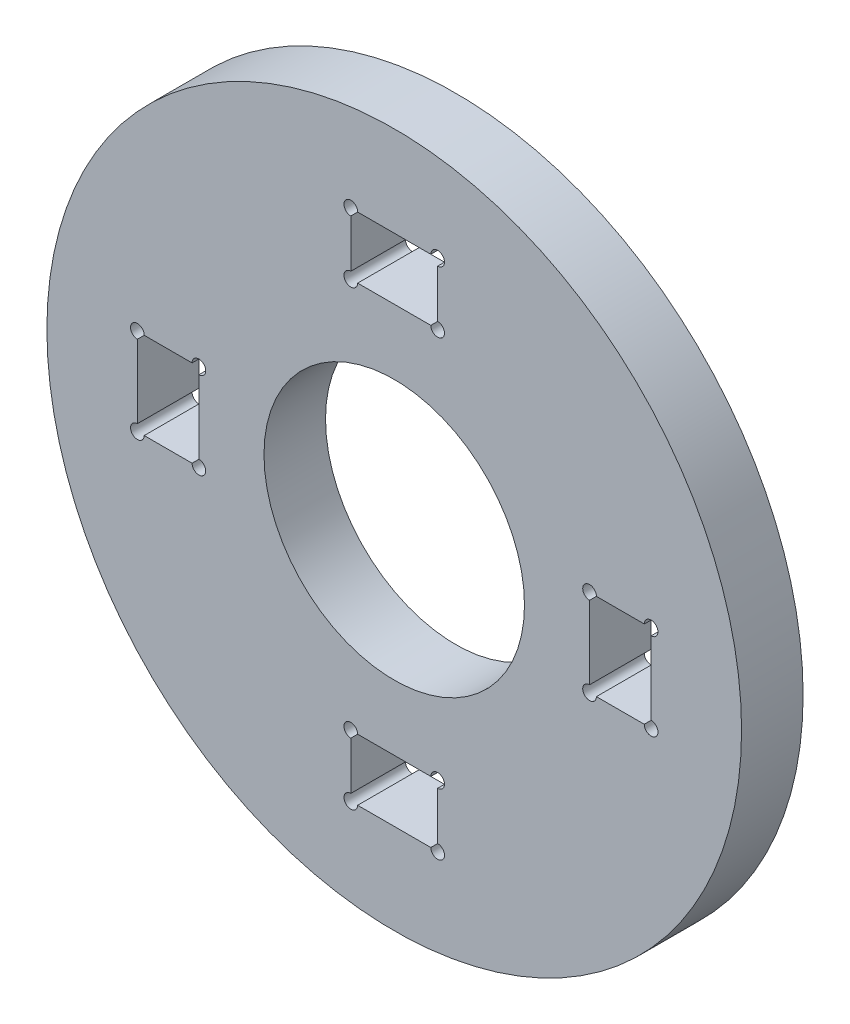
ISO-10303-21;
HEADER;
FILE_DESCRIPTION(('STEP AP214'),'2;1');
FILE_NAME('part.step','',(''),(''),'','','');
FILE_SCHEMA(('AUTOMOTIVE_DESIGN { 1 0 10303 214 1 1 1 1 }'));
ENDSEC;
DATA;
#1=APPLICATION_CONTEXT('core data for automotive mechanical design processes');
#2=APPLICATION_PROTOCOL_DEFINITION('international standard','automotive_design',2000,#1);
#3=PRODUCT_CONTEXT('',#1,'mechanical');
#4=PRODUCT('Part','Part','',(#3));
#5=PRODUCT_RELATED_PRODUCT_CATEGORY('part','',(#4));
#6=PRODUCT_DEFINITION_FORMATION('','',#4);
#7=PRODUCT_DEFINITION_CONTEXT('part definition',#1,'design');
#8=PRODUCT_DEFINITION('design','',#6,#7);
#9=PRODUCT_DEFINITION_SHAPE('','',#8);
#10=(LENGTH_UNIT() NAMED_UNIT(*) SI_UNIT(.MILLI.,.METRE.));
#11=(NAMED_UNIT(*) PLANE_ANGLE_UNIT() SI_UNIT($,.RADIAN.));
#12=(NAMED_UNIT(*) SI_UNIT($,.STERADIAN.) SOLID_ANGLE_UNIT());
#13=UNCERTAINTY_MEASURE_WITH_UNIT(LENGTH_MEASURE(1.E-05),#10,'distance_accuracy_value','');
#14=(GEOMETRIC_REPRESENTATION_CONTEXT(3) GLOBAL_UNCERTAINTY_ASSIGNED_CONTEXT((#13)) GLOBAL_UNIT_ASSIGNED_CONTEXT((#10,
#11,#12)) REPRESENTATION_CONTEXT('',''));
#15=CARTESIAN_POINT('',(0.,0.,0.));
#16=DIRECTION('',(0.,0.,1.));
#17=DIRECTION('',(1.,0.,0.));
#18=AXIS2_PLACEMENT_3D('',#15,#16,#17);
#19=CARTESIAN_POINT('',(0.,0.,4.5));
#20=DIRECTION('',(0.,0.,1.));
#21=DIRECTION('',(1.,0.,0.));
#22=AXIS2_PLACEMENT_3D('',#19,#20,#21);
#23=PLANE('',#22);
#24=CARTESIAN_POINT('',(0.,0.,4.5));
#25=DIRECTION('',(0.,0.,1.));
#26=DIRECTION('',(1.,0.,0.));
#27=AXIS2_PLACEMENT_3D('',#24,#25,#26);
#28=CIRCLE('',#27,9.525);
#29=CARTESIAN_POINT('',(9.525,0.,4.5));
#30=VERTEX_POINT('',#29);
#31=EDGE_CURVE('E266',#30,#30,#28,.T.);
#32=ORIENTED_EDGE('',*,*,#31,.F.);
#33=EDGE_LOOP('',(#32));
#34=FACE_BOUND('',#33,.T.);
#35=CARTESIAN_POINT('',(-18.7835533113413,3.17500000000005,4.5));
#36=DIRECTION('',(0.,0.,1.));
#37=DIRECTION('',(1.,0.,0.));
#38=AXIS2_PLACEMENT_3D('',#35,#36,#37);
#39=CIRCLE('',#38,0.5);
#40=CARTESIAN_POINT('',(-18.7835533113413,2.67500000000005,4.5));
#41=VERTEX_POINT('',#40);
#42=CARTESIAN_POINT('',(-18.2835533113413,3.17500000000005,4.5));
#43=VERTEX_POINT('',#42);
#44=EDGE_CURVE('E283',#41,#43,#39,.F.);
#45=ORIENTED_EDGE('',*,*,#44,.T.);
#46=DIRECTION('',(1.,0.,0.));
#47=VECTOR('',#46,1.);
#48=CARTESIAN_POINT('',(0.,3.175,4.5));
#49=LINE('',#48,#47);
#50=CARTESIAN_POINT('',(-14.7835533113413,3.17500000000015,4.5));
#51=VERTEX_POINT('',#50);
#52=EDGE_CURVE('E48',#43,#51,#49,.T.);
#53=ORIENTED_EDGE('',*,*,#52,.T.);
#54=CARTESIAN_POINT('',(-14.2835533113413,3.17500000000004,4.5));
#55=DIRECTION('',(0.,0.,1.));
#56=DIRECTION('',(1.,0.,0.));
#57=AXIS2_PLACEMENT_3D('',#54,#55,#56);
#58=CIRCLE('',#57,0.5);
#59=CARTESIAN_POINT('',(-14.2835533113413,2.67500000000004,4.5));
#60=VERTEX_POINT('',#59);
#61=EDGE_CURVE('E260',#51,#60,#58,.F.);
#62=ORIENTED_EDGE('',*,*,#61,.T.);
#63=DIRECTION('',(0.,1.,0.));
#64=VECTOR('',#63,1.);
#65=CARTESIAN_POINT('',(-14.2835533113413,1.4827788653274E-13,4.5));
#66=LINE('',#65,#64);
#67=CARTESIAN_POINT('',(-14.2835533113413,-2.67499999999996,4.5));
#68=VERTEX_POINT('',#67);
#69=EDGE_CURVE('E263',#68,#60,#66,.T.);
#70=ORIENTED_EDGE('',*,*,#69,.F.);
#71=CARTESIAN_POINT('',(-14.2835533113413,-3.17499999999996,4.5));
#72=DIRECTION('',(0.,0.,1.));
#73=DIRECTION('',(1.,0.,0.));
#74=AXIS2_PLACEMENT_3D('',#71,#72,#73);
#75=CIRCLE('',#74,0.5);
#76=CARTESIAN_POINT('',(-14.7835533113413,-3.17499999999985,4.5));
#77=VERTEX_POINT('',#76);
#78=EDGE_CURVE('E295',#77,#68,#75,.T.);
#79=ORIENTED_EDGE('',*,*,#78,.F.);
#80=DIRECTION('',(1.,0.,0.));
#81=VECTOR('',#80,1.);
#82=CARTESIAN_POINT('',(0.,-3.175,4.5));
#83=LINE('',#82,#81);
#84=CARTESIAN_POINT('',(-18.2835533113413,-3.17499999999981,4.5));
#85=VERTEX_POINT('',#84);
#86=EDGE_CURVE('E292',#85,#77,#83,.T.);
#87=ORIENTED_EDGE('',*,*,#86,.F.);
#88=CARTESIAN_POINT('',(-18.7835533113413,-3.17499999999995,4.5));
#89=DIRECTION('',(0.,0.,1.));
#90=DIRECTION('',(1.,0.,0.));
#91=AXIS2_PLACEMENT_3D('',#88,#89,#90);
#92=CIRCLE('',#91,0.5);
#93=CARTESIAN_POINT('',(-18.7835533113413,-2.67499999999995,4.5));
#94=VERTEX_POINT('',#93);
#95=EDGE_CURVE('E289',#94,#85,#92,.T.);
#96=ORIENTED_EDGE('',*,*,#95,.F.);
#97=DIRECTION('',(0.,1.,0.));
#98=VECTOR('',#97,1.);
#99=CARTESIAN_POINT('',(-18.7835533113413,2.05255249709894E-13,4.5));
#100=LINE('',#99,#98);
#101=EDGE_CURVE('E286',#94,#41,#100,.T.);
#102=ORIENTED_EDGE('',*,*,#101,.T.);
#103=EDGE_LOOP('',(#45,#53,#62,#70,#79,#87,#96,#102));
#104=FACE_BOUND('',#103,.T.);
#105=CARTESIAN_POINT('',(18.7835533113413,-3.17500000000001,4.5));
#106=DIRECTION('',(0.,0.,1.));
#107=DIRECTION('',(1.,0.,0.));
#108=AXIS2_PLACEMENT_3D('',#105,#106,#107);
#109=CIRCLE('',#108,0.5);
#110=CARTESIAN_POINT('',(18.7835533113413,-2.67500000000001,4.5));
#111=VERTEX_POINT('',#110);
#112=CARTESIAN_POINT('',(18.2835533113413,-3.17500000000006,4.5));
#113=VERTEX_POINT('',#112);
#114=EDGE_CURVE('E401',#111,#113,#109,.F.);
#115=ORIENTED_EDGE('',*,*,#114,.T.);
#116=DIRECTION('',(-1.,0.,0.));
#117=VECTOR('',#116,1.);
#118=CARTESIAN_POINT('',(0.,-3.175,4.5));
#119=LINE('',#118,#117);
#120=CARTESIAN_POINT('',(14.7835533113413,-3.17500000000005,4.5));
#121=VERTEX_POINT('',#120);
#122=EDGE_CURVE('E361',#113,#121,#119,.T.);
#123=ORIENTED_EDGE('',*,*,#122,.T.);
#124=CARTESIAN_POINT('',(14.2835533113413,-3.17500000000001,4.5));
#125=DIRECTION('',(0.,0.,1.));
#126=DIRECTION('',(1.,0.,0.));
#127=AXIS2_PLACEMENT_3D('',#124,#125,#126);
#128=CIRCLE('',#127,0.5);
#129=CARTESIAN_POINT('',(14.2835533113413,-2.67500000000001,4.5));
#130=VERTEX_POINT('',#129);
#131=EDGE_CURVE('E379',#121,#130,#128,.F.);
#132=ORIENTED_EDGE('',*,*,#131,.T.);
#133=DIRECTION('',(0.,-1.,0.));
#134=VECTOR('',#133,1.);
#135=CARTESIAN_POINT('',(14.2835533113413,0.,4.5));
#136=LINE('',#135,#134);
#137=CARTESIAN_POINT('',(14.2835533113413,2.67499999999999,4.5));
#138=VERTEX_POINT('',#137);
#139=EDGE_CURVE('E416',#138,#130,#136,.T.);
#140=ORIENTED_EDGE('',*,*,#139,.F.);
#141=CARTESIAN_POINT('',(14.2835533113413,3.17499999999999,4.5));
#142=DIRECTION('',(0.,0.,1.));
#143=DIRECTION('',(1.,0.,0.));
#144=AXIS2_PLACEMENT_3D('',#141,#142,#143);
#145=CIRCLE('',#144,0.5);
#146=CARTESIAN_POINT('',(14.7835533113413,3.17499999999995,4.5));
#147=VERTEX_POINT('',#146);
#148=EDGE_CURVE('E413',#147,#138,#145,.T.);
#149=ORIENTED_EDGE('',*,*,#148,.F.);
#150=DIRECTION('',(-1.,0.,0.));
#151=VECTOR('',#150,1.);
#152=CARTESIAN_POINT('',(0.,3.175,4.5));
#153=LINE('',#152,#151);
#154=CARTESIAN_POINT('',(18.2835533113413,3.17499999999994,4.5));
#155=VERTEX_POINT('',#154);
#156=EDGE_CURVE('E410',#155,#147,#153,.T.);
#157=ORIENTED_EDGE('',*,*,#156,.F.);
#158=CARTESIAN_POINT('',(18.7835533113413,3.17499999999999,4.5));
#159=DIRECTION('',(0.,0.,1.));
#160=DIRECTION('',(1.,0.,0.));
#161=AXIS2_PLACEMENT_3D('',#158,#159,#160);
#162=CIRCLE('',#161,0.5);
#163=CARTESIAN_POINT('',(18.7835533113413,2.67499999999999,4.5));
#164=VERTEX_POINT('',#163);
#165=EDGE_CURVE('E407',#164,#155,#162,.T.);
#166=ORIENTED_EDGE('',*,*,#165,.F.);
#167=DIRECTION('',(0.,-1.,0.));
#168=VECTOR('',#167,1.);
#169=CARTESIAN_POINT('',(18.7835533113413,0.,4.5));
#170=LINE('',#169,#168);
#171=EDGE_CURVE('E404',#164,#111,#170,.T.);
#172=ORIENTED_EDGE('',*,*,#171,.T.);
#173=EDGE_LOOP('',(#115,#123,#132,#140,#149,#157,#166,#172));
#174=FACE_BOUND('',#173,.T.);
#175=CARTESIAN_POINT('',(0.,0.,4.5));
#176=DIRECTION('',(0.,0.,1.));
#177=DIRECTION('',(1.,0.,0.));
#178=AXIS2_PLACEMENT_3D('',#175,#176,#177);
#179=CIRCLE('',#178,25.4);
#180=CARTESIAN_POINT('',(25.4,0.,4.5));
#181=VERTEX_POINT('',#180);
#182=EDGE_CURVE('E11',#181,#181,#179,.T.);
#183=ORIENTED_EDGE('',*,*,#182,.T.);
#184=EDGE_LOOP('',(#183));
#185=FACE_BOUND('',#184,.T.);
#186=DIRECTION('',(1.,0.,0.));
#187=VECTOR('',#186,1.);
#188=CARTESIAN_POINT('',(0.,18.7835533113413,4.5));
#189=LINE('',#188,#187);
#190=CARTESIAN_POINT('',(-2.675,18.7835533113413,4.5));
#191=VERTEX_POINT('',#190);
#192=CARTESIAN_POINT('',(2.675,18.7835533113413,4.5));
#193=VERTEX_POINT('',#192);
#194=EDGE_CURVE('E463',#191,#193,#189,.T.);
#195=ORIENTED_EDGE('',*,*,#194,.T.);
#196=CARTESIAN_POINT('',(3.175,18.7835533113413,4.5));
#197=DIRECTION('',(0.,0.,1.));
#198=DIRECTION('',(1.,0.,0.));
#199=AXIS2_PLACEMENT_3D('',#196,#197,#198);
#200=CIRCLE('',#199,0.5);
#201=CARTESIAN_POINT('',(3.175,18.2835533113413,4.5));
#202=VERTEX_POINT('',#201);
#203=EDGE_CURVE('E424',#193,#202,#200,.F.);
#204=ORIENTED_EDGE('',*,*,#203,.T.);
#205=DIRECTION('',(0.,-1.,0.));
#206=VECTOR('',#205,1.);
#207=CARTESIAN_POINT('',(3.175,0.,4.5));
#208=LINE('',#207,#206);
#209=CARTESIAN_POINT('',(3.175,14.7835533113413,4.5));
#210=VERTEX_POINT('',#209);
#211=EDGE_CURVE('E442',#202,#210,#208,.T.);
#212=ORIENTED_EDGE('',*,*,#211,.T.);
#213=CARTESIAN_POINT('',(3.175,14.2835533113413,4.5));
#214=DIRECTION('',(0.,0.,1.));
#215=DIRECTION('',(1.,0.,0.));
#216=AXIS2_PLACEMENT_3D('',#213,#214,#215);
#217=CIRCLE('',#216,0.5);
#218=CARTESIAN_POINT('',(2.675,14.2835533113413,4.5));
#219=VERTEX_POINT('',#218);
#220=EDGE_CURVE('E478',#210,#219,#217,.F.);
#221=ORIENTED_EDGE('',*,*,#220,.T.);
#222=DIRECTION('',(1.,0.,0.));
#223=VECTOR('',#222,1.);
#224=CARTESIAN_POINT('',(0.,14.2835533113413,4.5));
#225=LINE('',#224,#223);
#226=CARTESIAN_POINT('',(-2.675,14.2835533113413,4.5));
#227=VERTEX_POINT('',#226);
#228=EDGE_CURVE('E475',#227,#219,#225,.T.);
#229=ORIENTED_EDGE('',*,*,#228,.F.);
#230=CARTESIAN_POINT('',(-3.175,14.2835533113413,4.5));
#231=DIRECTION('',(0.,0.,1.));
#232=DIRECTION('',(1.,0.,0.));
#233=AXIS2_PLACEMENT_3D('',#230,#231,#232);
#234=CIRCLE('',#233,0.5);
#235=CARTESIAN_POINT('',(-3.175,14.7835533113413,4.5));
#236=VERTEX_POINT('',#235);
#237=EDGE_CURVE('E472',#236,#227,#234,.T.);
#238=ORIENTED_EDGE('',*,*,#237,.F.);
#239=DIRECTION('',(0.,-1.,0.));
#240=VECTOR('',#239,1.);
#241=CARTESIAN_POINT('',(-3.175,0.,4.5));
#242=LINE('',#241,#240);
#243=CARTESIAN_POINT('',(-3.175,18.2835533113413,4.5));
#244=VERTEX_POINT('',#243);
#245=EDGE_CURVE('E469',#244,#236,#242,.T.);
#246=ORIENTED_EDGE('',*,*,#245,.F.);
#247=CARTESIAN_POINT('',(-3.175,18.7835533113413,4.5));
#248=DIRECTION('',(0.,0.,1.));
#249=DIRECTION('',(1.,0.,0.));
#250=AXIS2_PLACEMENT_3D('',#247,#248,#249);
#251=CIRCLE('',#250,0.5);
#252=EDGE_CURVE('E466',#191,#244,#251,.T.);
#253=ORIENTED_EDGE('',*,*,#252,.F.);
#254=EDGE_LOOP('',(#195,#204,#212,#221,#229,#238,#246,#253));
#255=FACE_BOUND('',#254,.T.);
#256=DIRECTION('',(-1.,0.,0.));
#257=VECTOR('',#256,1.);
#258=CARTESIAN_POINT('',(-1.23153149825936E-13,-18.7835533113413,4.5));
#259=LINE('',#258,#257);
#260=CARTESIAN_POINT('',(2.67499999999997,-18.7835533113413,4.5));
#261=VERTEX_POINT('',#260);
#262=CARTESIAN_POINT('',(-2.67500000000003,-18.7835533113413,4.5));
#263=VERTEX_POINT('',#262);
#264=EDGE_CURVE('E338',#261,#263,#259,.T.);
#265=ORIENTED_EDGE('',*,*,#264,.T.);
#266=CARTESIAN_POINT('',(-3.17500000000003,-18.7835533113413,4.5));
#267=DIRECTION('',(0.,0.,1.));
#268=DIRECTION('',(1.,0.,0.));
#269=AXIS2_PLACEMENT_3D('',#266,#267,#268);
#270=CIRCLE('',#269,0.5);
#271=CARTESIAN_POINT('',(-3.17500000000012,-18.2835533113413,4.5));
#272=VERTEX_POINT('',#271);
#273=EDGE_CURVE('E302',#263,#272,#270,.F.);
#274=ORIENTED_EDGE('',*,*,#273,.T.);
#275=DIRECTION('',(0.,1.,0.));
#276=VECTOR('',#275,1.);
#277=CARTESIAN_POINT('',(-3.175,0.,4.5));
#278=LINE('',#277,#276);
#279=CARTESIAN_POINT('',(-3.1750000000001,-14.7835533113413,4.5));
#280=VERTEX_POINT('',#279);
#281=EDGE_CURVE('E317',#272,#280,#278,.T.);
#282=ORIENTED_EDGE('',*,*,#281,.T.);
#283=CARTESIAN_POINT('',(-3.17500000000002,-14.2835533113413,4.5));
#284=DIRECTION('',(0.,0.,1.));
#285=DIRECTION('',(1.,0.,0.));
#286=AXIS2_PLACEMENT_3D('',#283,#284,#285);
#287=CIRCLE('',#286,0.5);
#288=CARTESIAN_POINT('',(-2.67500000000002,-14.2835533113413,4.5));
#289=VERTEX_POINT('',#288);
#290=EDGE_CURVE('E353',#280,#289,#287,.F.);
#291=ORIENTED_EDGE('',*,*,#290,.T.);
#292=DIRECTION('',(-1.,0.,0.));
#293=VECTOR('',#292,1.);
#294=CARTESIAN_POINT('',(-1.01453290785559E-13,-14.2835533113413,4.5));
#295=LINE('',#294,#293);
#296=CARTESIAN_POINT('',(2.67499999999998,-14.2835533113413,4.5));
#297=VERTEX_POINT('',#296);
#298=EDGE_CURVE('E350',#297,#289,#295,.T.);
#299=ORIENTED_EDGE('',*,*,#298,.F.);
#300=CARTESIAN_POINT('',(3.17499999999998,-14.2835533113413,4.5));
#301=DIRECTION('',(0.,0.,1.));
#302=DIRECTION('',(1.,0.,0.));
#303=AXIS2_PLACEMENT_3D('',#300,#301,#302);
#304=CIRCLE('',#303,0.5);
#305=CARTESIAN_POINT('',(3.1749999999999,-14.7835533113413,4.5));
#306=VERTEX_POINT('',#305);
#307=EDGE_CURVE('E347',#306,#297,#304,.T.);
#308=ORIENTED_EDGE('',*,*,#307,.F.);
#309=DIRECTION('',(0.,1.,0.));
#310=VECTOR('',#309,1.);
#311=CARTESIAN_POINT('',(3.175,0.,4.5));
#312=LINE('',#311,#310);
#313=CARTESIAN_POINT('',(3.17499999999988,-18.2835533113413,4.5));
#314=VERTEX_POINT('',#313);
#315=EDGE_CURVE('E344',#314,#306,#312,.T.);
#316=ORIENTED_EDGE('',*,*,#315,.F.);
#317=CARTESIAN_POINT('',(3.17499999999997,-18.7835533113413,4.5));
#318=DIRECTION('',(0.,0.,1.));
#319=DIRECTION('',(1.,0.,0.));
#320=AXIS2_PLACEMENT_3D('',#317,#318,#319);
#321=CIRCLE('',#320,0.5);
#322=EDGE_CURVE('E341',#261,#314,#321,.T.);
#323=ORIENTED_EDGE('',*,*,#322,.F.);
#324=EDGE_LOOP('',(#265,#274,#282,#291,#299,#308,#316,#323));
#325=FACE_BOUND('',#324,.T.);
#326=ADVANCED_FACE('F33',(#34,#104,#174,#185,#255,#325),#23,.T.);
#327=CARTESIAN_POINT('',(0.,0.,0.));
#328=DIRECTION('',(0.,0.,1.));
#329=DIRECTION('',(1.,0.,0.));
#330=AXIS2_PLACEMENT_3D('',#327,#328,#329);
#331=PLANE('',#330);
#332=CARTESIAN_POINT('',(0.,0.,0.));
#333=DIRECTION('',(0.,0.,1.));
#334=DIRECTION('',(1.,0.,0.));
#335=AXIS2_PLACEMENT_3D('',#332,#333,#334);
#336=CIRCLE('',#335,9.525);
#337=CARTESIAN_POINT('',(9.525,0.,0.));
#338=VERTEX_POINT('',#337);
#339=EDGE_CURVE('E284',#338,#338,#336,.T.);
#340=ORIENTED_EDGE('',*,*,#339,.T.);
#341=EDGE_LOOP('',(#340));
#342=FACE_BOUND('',#341,.T.);
#343=DIRECTION('',(1.,0.,0.));
#344=VECTOR('',#343,1.);
#345=CARTESIAN_POINT('',(0.,3.175,0.));
#346=LINE('',#345,#344);
#347=CARTESIAN_POINT('',(-18.2835533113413,3.17500000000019,0.));
#348=VERTEX_POINT('',#347);
#349=CARTESIAN_POINT('',(-14.7835533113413,3.17500000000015,0.));
#350=VERTEX_POINT('',#349);
#351=EDGE_CURVE('E250',#348,#350,#346,.T.);
#352=ORIENTED_EDGE('',*,*,#351,.F.);
#353=CARTESIAN_POINT('',(-18.7835533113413,3.17500000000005,0.));
#354=DIRECTION('',(0.,0.,1.));
#355=DIRECTION('',(1.,0.,0.));
#356=AXIS2_PLACEMENT_3D('',#353,#354,#355);
#357=CIRCLE('',#356,0.5);
#358=CARTESIAN_POINT('',(-18.7835533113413,2.67500000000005,0.));
#359=VERTEX_POINT('',#358);
#360=EDGE_CURVE('E242',#359,#348,#357,.F.);
#361=ORIENTED_EDGE('',*,*,#360,.F.);
#362=DIRECTION('',(0.,1.,0.));
#363=VECTOR('',#362,1.);
#364=CARTESIAN_POINT('',(-18.7835533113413,2.05255249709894E-13,0.));
#365=LINE('',#364,#363);
#366=CARTESIAN_POINT('',(-18.7835533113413,-2.67499999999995,0.));
#367=VERTEX_POINT('',#366);
#368=EDGE_CURVE('E249',#367,#359,#365,.T.);
#369=ORIENTED_EDGE('',*,*,#368,.F.);
#370=CARTESIAN_POINT('',(-18.7835533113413,-3.17499999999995,0.));
#371=DIRECTION('',(0.,0.,1.));
#372=DIRECTION('',(1.,0.,0.));
#373=AXIS2_PLACEMENT_3D('',#370,#371,#372);
#374=CIRCLE('',#373,0.5);
#375=CARTESIAN_POINT('',(-18.2835533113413,-3.17499999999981,0.));
#376=VERTEX_POINT('',#375);
#377=EDGE_CURVE('E270',#367,#376,#374,.T.);
#378=ORIENTED_EDGE('',*,*,#377,.T.);
#379=DIRECTION('',(1.,0.,0.));
#380=VECTOR('',#379,1.);
#381=CARTESIAN_POINT('',(0.,-3.175,0.));
#382=LINE('',#381,#380);
#383=CARTESIAN_POINT('',(-14.7835533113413,-3.17499999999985,0.));
#384=VERTEX_POINT('',#383);
#385=EDGE_CURVE('E273',#376,#384,#382,.T.);
#386=ORIENTED_EDGE('',*,*,#385,.T.);
#387=CARTESIAN_POINT('',(-14.2835533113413,-3.17499999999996,0.));
#388=DIRECTION('',(0.,0.,1.));
#389=DIRECTION('',(1.,0.,0.));
#390=AXIS2_PLACEMENT_3D('',#387,#388,#389);
#391=CIRCLE('',#390,0.5);
#392=CARTESIAN_POINT('',(-14.2835533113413,-2.67499999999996,0.));
#393=VERTEX_POINT('',#392);
#394=EDGE_CURVE('E276',#384,#393,#391,.T.);
#395=ORIENTED_EDGE('',*,*,#394,.T.);
#396=DIRECTION('',(0.,1.,0.));
#397=VECTOR('',#396,1.);
#398=CARTESIAN_POINT('',(-14.2835533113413,1.4827788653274E-13,0.));
#399=LINE('',#398,#397);
#400=CARTESIAN_POINT('',(-14.2835533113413,2.67500000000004,0.));
#401=VERTEX_POINT('',#400);
#402=EDGE_CURVE('E279',#393,#401,#399,.T.);
#403=ORIENTED_EDGE('',*,*,#402,.T.);
#404=CARTESIAN_POINT('',(-14.2835533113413,3.17500000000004,0.));
#405=DIRECTION('',(0.,0.,1.));
#406=DIRECTION('',(1.,0.,0.));
#407=AXIS2_PLACEMENT_3D('',#404,#405,#406);
#408=CIRCLE('',#407,0.5);
#409=EDGE_CURVE('E254',#350,#401,#408,.F.);
#410=ORIENTED_EDGE('',*,*,#409,.F.);
#411=EDGE_LOOP('',(#352,#361,#369,#378,#386,#395,#403,#410));
#412=FACE_BOUND('',#411,.T.);
#413=CARTESIAN_POINT('',(3.175,18.7835533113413,0.));
#414=DIRECTION('',(0.,0.,1.));
#415=DIRECTION('',(1.,0.,0.));
#416=AXIS2_PLACEMENT_3D('',#413,#414,#415);
#417=CIRCLE('',#416,0.5);
#418=CARTESIAN_POINT('',(2.675,18.7835533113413,0.));
#419=VERTEX_POINT('',#418);
#420=CARTESIAN_POINT('',(3.175,18.2835533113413,0.));
#421=VERTEX_POINT('',#420);
#422=EDGE_CURVE('E439',#419,#421,#417,.F.);
#423=ORIENTED_EDGE('',*,*,#422,.F.);
#424=DIRECTION('',(1.,0.,0.));
#425=VECTOR('',#424,1.);
#426=CARTESIAN_POINT('',(0.,18.7835533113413,0.));
#427=LINE('',#426,#425);
#428=CARTESIAN_POINT('',(-2.675,18.7835533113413,0.));
#429=VERTEX_POINT('',#428);
#430=EDGE_CURVE('E441',#429,#419,#427,.T.);
#431=ORIENTED_EDGE('',*,*,#430,.F.);
#432=CARTESIAN_POINT('',(-3.175,18.7835533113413,0.));
#433=DIRECTION('',(0.,0.,1.));
#434=DIRECTION('',(1.,0.,0.));
#435=AXIS2_PLACEMENT_3D('',#432,#433,#434);
#436=CIRCLE('',#435,0.5);
#437=CARTESIAN_POINT('',(-3.175,18.2835533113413,0.));
#438=VERTEX_POINT('',#437);
#439=EDGE_CURVE('E444',#429,#438,#436,.T.);
#440=ORIENTED_EDGE('',*,*,#439,.T.);
#441=DIRECTION('',(0.,-1.,0.));
#442=VECTOR('',#441,1.);
#443=CARTESIAN_POINT('',(-3.175,0.,0.));
#444=LINE('',#443,#442);
#445=CARTESIAN_POINT('',(-3.175,14.7835533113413,0.));
#446=VERTEX_POINT('',#445);
#447=EDGE_CURVE('E447',#438,#446,#444,.T.);
#448=ORIENTED_EDGE('',*,*,#447,.T.);
#449=CARTESIAN_POINT('',(-3.175,14.2835533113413,0.));
#450=DIRECTION('',(0.,0.,1.));
#451=DIRECTION('',(1.,0.,0.));
#452=AXIS2_PLACEMENT_3D('',#449,#450,#451);
#453=CIRCLE('',#452,0.5);
#454=CARTESIAN_POINT('',(-2.675,14.2835533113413,0.));
#455=VERTEX_POINT('',#454);
#456=EDGE_CURVE('E450',#446,#455,#453,.T.);
#457=ORIENTED_EDGE('',*,*,#456,.T.);
#458=DIRECTION('',(1.,0.,0.));
#459=VECTOR('',#458,1.);
#460=CARTESIAN_POINT('',(0.,14.2835533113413,0.));
#461=LINE('',#460,#459);
#462=CARTESIAN_POINT('',(2.675,14.2835533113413,0.));
#463=VERTEX_POINT('',#462);
#464=EDGE_CURVE('E453',#455,#463,#461,.T.);
#465=ORIENTED_EDGE('',*,*,#464,.T.);
#466=CARTESIAN_POINT('',(3.175,14.2835533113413,0.));
#467=DIRECTION('',(0.,0.,1.));
#468=DIRECTION('',(1.,0.,0.));
#469=AXIS2_PLACEMENT_3D('',#466,#467,#468);
#470=CIRCLE('',#469,0.5);
#471=CARTESIAN_POINT('',(3.175,14.7835533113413,0.));
#472=VERTEX_POINT('',#471);
#473=EDGE_CURVE('E456',#472,#463,#470,.F.);
#474=ORIENTED_EDGE('',*,*,#473,.F.);
#475=DIRECTION('',(0.,-1.,0.));
#476=VECTOR('',#475,1.);
#477=CARTESIAN_POINT('',(3.175,0.,0.));
#478=LINE('',#477,#476);
#479=EDGE_CURVE('E458',#421,#472,#478,.T.);
#480=ORIENTED_EDGE('',*,*,#479,.F.);
#481=EDGE_LOOP('',(#423,#431,#440,#448,#457,#465,#474,#480));
#482=FACE_BOUND('',#481,.T.);
#483=CARTESIAN_POINT('',(0.,0.,0.));
#484=DIRECTION('',(0.,0.,1.));
#485=DIRECTION('',(1.,0.,0.));
#486=AXIS2_PLACEMENT_3D('',#483,#484,#485);
#487=CIRCLE('',#486,25.4);
#488=CARTESIAN_POINT('',(25.4,0.,0.));
#489=VERTEX_POINT('',#488);
#490=EDGE_CURVE('E37',#489,#489,#487,.T.);
#491=ORIENTED_EDGE('',*,*,#490,.F.);
#492=EDGE_LOOP('',(#491));
#493=FACE_BOUND('',#492,.T.);
#494=DIRECTION('',(-1.,0.,0.));
#495=VECTOR('',#494,1.);
#496=CARTESIAN_POINT('',(0.,-3.175,0.));
#497=LINE('',#496,#495);
#498=CARTESIAN_POINT('',(18.2835533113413,-3.17500000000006,0.));
#499=VERTEX_POINT('',#498);
#500=CARTESIAN_POINT('',(14.7835533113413,-3.17500000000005,0.));
#501=VERTEX_POINT('',#500);
#502=EDGE_CURVE('E376',#499,#501,#497,.T.);
#503=ORIENTED_EDGE('',*,*,#502,.F.);
#504=CARTESIAN_POINT('',(18.7835533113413,-3.17500000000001,0.));
#505=DIRECTION('',(0.,0.,1.));
#506=DIRECTION('',(1.,0.,0.));
#507=AXIS2_PLACEMENT_3D('',#504,#505,#506);
#508=CIRCLE('',#507,0.5);
#509=CARTESIAN_POINT('',(18.7835533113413,-2.67500000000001,0.));
#510=VERTEX_POINT('',#509);
#511=EDGE_CURVE('E378',#510,#499,#508,.F.);
#512=ORIENTED_EDGE('',*,*,#511,.F.);
#513=DIRECTION('',(0.,-1.,0.));
#514=VECTOR('',#513,1.);
#515=CARTESIAN_POINT('',(18.7835533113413,0.,0.));
#516=LINE('',#515,#514);
#517=CARTESIAN_POINT('',(18.7835533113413,2.67499999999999,0.));
#518=VERTEX_POINT('',#517);
#519=EDGE_CURVE('E381',#518,#510,#516,.T.);
#520=ORIENTED_EDGE('',*,*,#519,.F.);
#521=CARTESIAN_POINT('',(18.7835533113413,3.17499999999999,0.));
#522=DIRECTION('',(0.,0.,1.));
#523=DIRECTION('',(1.,0.,0.));
#524=AXIS2_PLACEMENT_3D('',#521,#522,#523);
#525=CIRCLE('',#524,0.5);
#526=CARTESIAN_POINT('',(18.2835533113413,3.17499999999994,0.));
#527=VERTEX_POINT('',#526);
#528=EDGE_CURVE('E384',#518,#527,#525,.T.);
#529=ORIENTED_EDGE('',*,*,#528,.T.);
#530=DIRECTION('',(-1.,0.,0.));
#531=VECTOR('',#530,1.);
#532=CARTESIAN_POINT('',(0.,3.175,0.));
#533=LINE('',#532,#531);
#534=CARTESIAN_POINT('',(14.7835533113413,3.17499999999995,0.));
#535=VERTEX_POINT('',#534);
#536=EDGE_CURVE('E387',#527,#535,#533,.T.);
#537=ORIENTED_EDGE('',*,*,#536,.T.);
#538=CARTESIAN_POINT('',(14.2835533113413,3.17499999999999,0.));
#539=DIRECTION('',(0.,0.,1.));
#540=DIRECTION('',(1.,0.,0.));
#541=AXIS2_PLACEMENT_3D('',#538,#539,#540);
#542=CIRCLE('',#541,0.5);
#543=CARTESIAN_POINT('',(14.2835533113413,2.67499999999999,0.));
#544=VERTEX_POINT('',#543);
#545=EDGE_CURVE('E390',#535,#544,#542,.T.);
#546=ORIENTED_EDGE('',*,*,#545,.T.);
#547=DIRECTION('',(0.,-1.,0.));
#548=VECTOR('',#547,1.);
#549=CARTESIAN_POINT('',(14.2835533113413,0.,0.));
#550=LINE('',#549,#548);
#551=CARTESIAN_POINT('',(14.2835533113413,-2.67500000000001,0.));
#552=VERTEX_POINT('',#551);
#553=EDGE_CURVE('E393',#544,#552,#550,.T.);
#554=ORIENTED_EDGE('',*,*,#553,.T.);
#555=CARTESIAN_POINT('',(14.2835533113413,-3.17500000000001,0.));
#556=DIRECTION('',(0.,0.,1.));
#557=DIRECTION('',(1.,0.,0.));
#558=AXIS2_PLACEMENT_3D('',#555,#556,#557);
#559=CIRCLE('',#558,0.5);
#560=EDGE_CURVE('E396',#501,#552,#559,.F.);
#561=ORIENTED_EDGE('',*,*,#560,.F.);
#562=EDGE_LOOP('',(#503,#512,#520,#529,#537,#546,#554,#561));
#563=FACE_BOUND('',#562,.T.);
#564=CARTESIAN_POINT('',(-3.17500000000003,-18.7835533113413,0.));
#565=DIRECTION('',(0.,0.,1.));
#566=DIRECTION('',(1.,0.,0.));
#567=AXIS2_PLACEMENT_3D('',#564,#565,#566);
#568=CIRCLE('',#567,0.5);
#569=CARTESIAN_POINT('',(-2.67500000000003,-18.7835533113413,0.));
#570=VERTEX_POINT('',#569);
#571=CARTESIAN_POINT('',(-3.17500000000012,-18.2835533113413,0.));
#572=VERTEX_POINT('',#571);
#573=EDGE_CURVE('E314',#570,#572,#568,.F.);
#574=ORIENTED_EDGE('',*,*,#573,.F.);
#575=DIRECTION('',(-1.,0.,0.));
#576=VECTOR('',#575,1.);
#577=CARTESIAN_POINT('',(-1.23153149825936E-13,-18.7835533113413,0.));
#578=LINE('',#577,#576);
#579=CARTESIAN_POINT('',(2.67499999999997,-18.7835533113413,0.));
#580=VERTEX_POINT('',#579);
#581=EDGE_CURVE('E316',#580,#570,#578,.T.);
#582=ORIENTED_EDGE('',*,*,#581,.F.);
#583=CARTESIAN_POINT('',(3.17499999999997,-18.7835533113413,0.));
#584=DIRECTION('',(0.,0.,1.));
#585=DIRECTION('',(1.,0.,0.));
#586=AXIS2_PLACEMENT_3D('',#583,#584,#585);
#587=CIRCLE('',#586,0.5);
#588=CARTESIAN_POINT('',(3.17499999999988,-18.2835533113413,0.));
#589=VERTEX_POINT('',#588);
#590=EDGE_CURVE('E319',#580,#589,#587,.T.);
#591=ORIENTED_EDGE('',*,*,#590,.T.);
#592=DIRECTION('',(0.,1.,0.));
#593=VECTOR('',#592,1.);
#594=CARTESIAN_POINT('',(3.175,0.,0.));
#595=LINE('',#594,#593);
#596=CARTESIAN_POINT('',(3.1749999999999,-14.7835533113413,0.));
#597=VERTEX_POINT('',#596);
#598=EDGE_CURVE('E322',#589,#597,#595,.T.);
#599=ORIENTED_EDGE('',*,*,#598,.T.);
#600=CARTESIAN_POINT('',(3.17499999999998,-14.2835533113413,0.));
#601=DIRECTION('',(0.,0.,1.));
#602=DIRECTION('',(1.,0.,0.));
#603=AXIS2_PLACEMENT_3D('',#600,#601,#602);
#604=CIRCLE('',#603,0.5);
#605=CARTESIAN_POINT('',(2.67499999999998,-14.2835533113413,0.));
#606=VERTEX_POINT('',#605);
#607=EDGE_CURVE('E325',#597,#606,#604,.T.);
#608=ORIENTED_EDGE('',*,*,#607,.T.);
#609=DIRECTION('',(-1.,0.,0.));
#610=VECTOR('',#609,1.);
#611=CARTESIAN_POINT('',(-1.01453290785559E-13,-14.2835533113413,0.));
#612=LINE('',#611,#610);
#613=CARTESIAN_POINT('',(-2.67500000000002,-14.2835533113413,0.));
#614=VERTEX_POINT('',#613);
#615=EDGE_CURVE('E328',#606,#614,#612,.T.);
#616=ORIENTED_EDGE('',*,*,#615,.T.);
#617=CARTESIAN_POINT('',(-3.17500000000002,-14.2835533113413,0.));
#618=DIRECTION('',(0.,0.,1.));
#619=DIRECTION('',(1.,0.,0.));
#620=AXIS2_PLACEMENT_3D('',#617,#618,#619);
#621=CIRCLE('',#620,0.5);
#622=CARTESIAN_POINT('',(-3.1750000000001,-14.7835533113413,0.));
#623=VERTEX_POINT('',#622);
#624=EDGE_CURVE('E331',#623,#614,#621,.F.);
#625=ORIENTED_EDGE('',*,*,#624,.F.);
#626=DIRECTION('',(0.,1.,0.));
#627=VECTOR('',#626,1.);
#628=CARTESIAN_POINT('',(-3.175,0.,0.));
#629=LINE('',#628,#627);
#630=EDGE_CURVE('E333',#572,#623,#629,.T.);
#631=ORIENTED_EDGE('',*,*,#630,.F.);
#632=EDGE_LOOP('',(#574,#582,#591,#599,#608,#616,#625,#631));
#633=FACE_BOUND('',#632,.T.);
#634=ADVANCED_FACE('F257',(#342,#412,#482,#493,#563,#633),#331,.F.);
#635=CARTESIAN_POINT('',(0.,0.,4.5));
#636=DIRECTION('',(0.,0.,-1.));
#637=DIRECTION('',(-1.,0.,0.));
#638=AXIS2_PLACEMENT_3D('',#635,#636,#637);
#639=CYLINDRICAL_SURFACE('',#638,25.4);
#640=ORIENTED_EDGE('',*,*,#182,.F.);
#641=EDGE_LOOP('',(#640));
#642=FACE_BOUND('',#641,.T.);
#643=ORIENTED_EDGE('',*,*,#490,.T.);
#644=EDGE_LOOP('',(#643));
#645=FACE_BOUND('',#644,.T.);
#646=ADVANCED_FACE('F35',(#642,#645),#639,.T.);
#647=CARTESIAN_POINT('',(3.175,18.7835533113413,0.));
#648=DIRECTION('',(0.,0.,1.));
#649=DIRECTION('',(1.,0.,0.));
#650=AXIS2_PLACEMENT_3D('',#647,#648,#649);
#651=CYLINDRICAL_SURFACE('',#650,0.5);
#652=ORIENTED_EDGE('',*,*,#203,.F.);
#653=DIRECTION('',(0.,0.,1.));
#654=VECTOR('',#653,1.);
#655=CARTESIAN_POINT('',(2.675,18.7835533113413,0.));
#656=LINE('',#655,#654);
#657=EDGE_CURVE('E460',#419,#193,#656,.T.);
#658=ORIENTED_EDGE('',*,*,#657,.F.);
#659=ORIENTED_EDGE('',*,*,#422,.T.);
#660=DIRECTION('',(0.,0.,1.));
#661=VECTOR('',#660,1.);
#662=CARTESIAN_POINT('',(3.175,18.2835533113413,0.));
#663=LINE('',#662,#661);
#664=EDGE_CURVE('E483',#421,#202,#663,.T.);
#665=ORIENTED_EDGE('',*,*,#664,.T.);
#666=EDGE_LOOP('',(#652,#658,#659,#665));
#667=FACE_BOUND('',#666,.T.);
#668=ADVANCED_FACE('F519',(#667),#651,.F.);
#669=CARTESIAN_POINT('',(3.175,0.,0.));
#670=DIRECTION('',(-1.,0.,0.));
#671=DIRECTION('',(0.,-1.,0.));
#672=AXIS2_PLACEMENT_3D('',#669,#670,#671);
#673=PLANE('',#672);
#674=ORIENTED_EDGE('',*,*,#211,.F.);
#675=ORIENTED_EDGE('',*,*,#664,.F.);
#676=ORIENTED_EDGE('',*,*,#479,.T.);
#677=DIRECTION('',(0.,0.,1.));
#678=VECTOR('',#677,1.);
#679=CARTESIAN_POINT('',(3.175,14.7835533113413,0.));
#680=LINE('',#679,#678);
#681=EDGE_CURVE('E486',#472,#210,#680,.T.);
#682=ORIENTED_EDGE('',*,*,#681,.T.);
#683=EDGE_LOOP('',(#674,#675,#676,#682));
#684=FACE_BOUND('',#683,.T.);
#685=ADVANCED_FACE('F521',(#684),#673,.T.);
#686=CARTESIAN_POINT('',(3.175,14.2835533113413,0.));
#687=DIRECTION('',(0.,0.,1.));
#688=DIRECTION('',(1.,0.,0.));
#689=AXIS2_PLACEMENT_3D('',#686,#687,#688);
#690=CYLINDRICAL_SURFACE('',#689,0.5);
#691=ORIENTED_EDGE('',*,*,#220,.F.);
#692=ORIENTED_EDGE('',*,*,#681,.F.);
#693=ORIENTED_EDGE('',*,*,#473,.T.);
#694=DIRECTION('',(0.,0.,1.));
#695=VECTOR('',#694,1.);
#696=CARTESIAN_POINT('',(2.675,14.2835533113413,0.));
#697=LINE('',#696,#695);
#698=EDGE_CURVE('E488',#463,#219,#697,.T.);
#699=ORIENTED_EDGE('',*,*,#698,.T.);
#700=EDGE_LOOP('',(#691,#692,#693,#699));
#701=FACE_BOUND('',#700,.T.);
#702=ADVANCED_FACE('F526',(#701),#690,.F.);
#703=CARTESIAN_POINT('',(0.,14.2835533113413,0.));
#704=DIRECTION('',(0.,-1.,0.));
#705=DIRECTION('',(0.,0.,-1.));
#706=AXIS2_PLACEMENT_3D('',#703,#704,#705);
#707=PLANE('',#706);
#708=ORIENTED_EDGE('',*,*,#228,.T.);
#709=ORIENTED_EDGE('',*,*,#698,.F.);
#710=ORIENTED_EDGE('',*,*,#464,.F.);
#711=DIRECTION('',(0.,0.,1.));
#712=VECTOR('',#711,1.);
#713=CARTESIAN_POINT('',(-2.675,14.2835533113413,0.));
#714=LINE('',#713,#712);
#715=EDGE_CURVE('E490',#455,#227,#714,.T.);
#716=ORIENTED_EDGE('',*,*,#715,.T.);
#717=EDGE_LOOP('',(#708,#709,#710,#716));
#718=FACE_BOUND('',#717,.T.);
#719=ADVANCED_FACE('F530',(#718),#707,.F.);
#720=CARTESIAN_POINT('',(-3.175,14.2835533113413,0.));
#721=DIRECTION('',(0.,0.,1.));
#722=DIRECTION('',(1.,0.,0.));
#723=AXIS2_PLACEMENT_3D('',#720,#721,#722);
#724=CYLINDRICAL_SURFACE('',#723,0.5);
#725=ORIENTED_EDGE('',*,*,#237,.T.);
#726=ORIENTED_EDGE('',*,*,#715,.F.);
#727=ORIENTED_EDGE('',*,*,#456,.F.);
#728=DIRECTION('',(0.,0.,1.));
#729=VECTOR('',#728,1.);
#730=CARTESIAN_POINT('',(-3.175,14.7835533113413,0.));
#731=LINE('',#730,#729);
#732=EDGE_CURVE('E492',#446,#236,#731,.T.);
#733=ORIENTED_EDGE('',*,*,#732,.T.);
#734=EDGE_LOOP('',(#725,#726,#727,#733));
#735=FACE_BOUND('',#734,.T.);
#736=ADVANCED_FACE('F533',(#735),#724,.F.);
#737=CARTESIAN_POINT('',(-3.175,0.,0.));
#738=DIRECTION('',(-1.,0.,0.));
#739=DIRECTION('',(0.,-1.,0.));
#740=AXIS2_PLACEMENT_3D('',#737,#738,#739);
#741=PLANE('',#740);
#742=ORIENTED_EDGE('',*,*,#245,.T.);
#743=ORIENTED_EDGE('',*,*,#732,.F.);
#744=ORIENTED_EDGE('',*,*,#447,.F.);
#745=DIRECTION('',(0.,0.,1.));
#746=VECTOR('',#745,1.);
#747=CARTESIAN_POINT('',(-3.175,18.2835533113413,0.));
#748=LINE('',#747,#746);
#749=EDGE_CURVE('E494',#438,#244,#748,.T.);
#750=ORIENTED_EDGE('',*,*,#749,.T.);
#751=EDGE_LOOP('',(#742,#743,#744,#750));
#752=FACE_BOUND('',#751,.T.);
#753=ADVANCED_FACE('F535',(#752),#741,.F.);
#754=CARTESIAN_POINT('',(-3.175,18.7835533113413,0.));
#755=DIRECTION('',(0.,0.,1.));
#756=DIRECTION('',(1.,0.,0.));
#757=AXIS2_PLACEMENT_3D('',#754,#755,#756);
#758=CYLINDRICAL_SURFACE('',#757,0.5);
#759=ORIENTED_EDGE('',*,*,#252,.T.);
#760=ORIENTED_EDGE('',*,*,#749,.F.);
#761=ORIENTED_EDGE('',*,*,#439,.F.);
#762=DIRECTION('',(0.,0.,1.));
#763=VECTOR('',#762,1.);
#764=CARTESIAN_POINT('',(-2.675,18.7835533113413,0.));
#765=LINE('',#764,#763);
#766=EDGE_CURVE('E496',#429,#191,#765,.T.);
#767=ORIENTED_EDGE('',*,*,#766,.T.);
#768=EDGE_LOOP('',(#759,#760,#761,#767));
#769=FACE_BOUND('',#768,.T.);
#770=ADVANCED_FACE('F513',(#769),#758,.F.);
#771=CARTESIAN_POINT('',(0.,18.7835533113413,0.));
#772=DIRECTION('',(0.,-1.,0.));
#773=DIRECTION('',(0.,0.,-1.));
#774=AXIS2_PLACEMENT_3D('',#771,#772,#773);
#775=PLANE('',#774);
#776=ORIENTED_EDGE('',*,*,#194,.F.);
#777=ORIENTED_EDGE('',*,*,#766,.F.);
#778=ORIENTED_EDGE('',*,*,#430,.T.);
#779=ORIENTED_EDGE('',*,*,#657,.T.);
#780=EDGE_LOOP('',(#776,#777,#778,#779));
#781=FACE_BOUND('',#780,.T.);
#782=ADVANCED_FACE('F502',(#781),#775,.T.);
#783=CARTESIAN_POINT('',(0.,-3.175,0.));
#784=DIRECTION('',(0.,1.,0.));
#785=DIRECTION('',(-1.,0.,0.));
#786=AXIS2_PLACEMENT_3D('',#783,#784,#785);
#787=PLANE('',#786);
#788=ORIENTED_EDGE('',*,*,#122,.F.);
#789=DIRECTION('',(0.,0.,1.));
#790=VECTOR('',#789,1.);
#791=CARTESIAN_POINT('',(18.2835533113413,-3.17500000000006,0.));
#792=LINE('',#791,#790);
#793=EDGE_CURVE('E398',#499,#113,#792,.T.);
#794=ORIENTED_EDGE('',*,*,#793,.F.);
#795=ORIENTED_EDGE('',*,*,#502,.T.);
#796=DIRECTION('',(0.,0.,1.));
#797=VECTOR('',#796,1.);
#798=CARTESIAN_POINT('',(14.7835533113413,-3.17500000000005,0.));
#799=LINE('',#798,#797);
#800=EDGE_CURVE('E421',#501,#121,#799,.T.);
#801=ORIENTED_EDGE('',*,*,#800,.T.);
#802=EDGE_LOOP('',(#788,#794,#795,#801));
#803=FACE_BOUND('',#802,.T.);
#804=ADVANCED_FACE('F558',(#803),#787,.T.);
#805=CARTESIAN_POINT('',(14.2835533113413,-3.17500000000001,0.));
#806=DIRECTION('',(0.,0.,1.));
#807=DIRECTION('',(1.,0.,0.));
#808=AXIS2_PLACEMENT_3D('',#805,#806,#807);
#809=CYLINDRICAL_SURFACE('',#808,0.5);
#810=ORIENTED_EDGE('',*,*,#131,.F.);
#811=ORIENTED_EDGE('',*,*,#800,.F.);
#812=ORIENTED_EDGE('',*,*,#560,.T.);
#813=DIRECTION('',(0.,0.,1.));
#814=VECTOR('',#813,1.);
#815=CARTESIAN_POINT('',(14.2835533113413,-2.67500000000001,0.));
#816=LINE('',#815,#814);
#817=EDGE_CURVE('E425',#552,#130,#816,.T.);
#818=ORIENTED_EDGE('',*,*,#817,.T.);
#819=EDGE_LOOP('',(#810,#811,#812,#818));
#820=FACE_BOUND('',#819,.T.);
#821=ADVANCED_FACE('F562',(#820),#809,.F.);
#822=CARTESIAN_POINT('',(14.2835533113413,0.,0.));
#823=DIRECTION('',(-1.,0.,0.));
#824=DIRECTION('',(0.,-1.,0.));
#825=AXIS2_PLACEMENT_3D('',#822,#823,#824);
#826=PLANE('',#825);
#827=ORIENTED_EDGE('',*,*,#139,.T.);
#828=ORIENTED_EDGE('',*,*,#817,.F.);
#829=ORIENTED_EDGE('',*,*,#553,.F.);
#830=DIRECTION('',(0.,0.,1.));
#831=VECTOR('',#830,1.);
#832=CARTESIAN_POINT('',(14.2835533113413,2.67499999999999,0.));
#833=LINE('',#832,#831);
#834=EDGE_CURVE('E427',#544,#138,#833,.T.);
#835=ORIENTED_EDGE('',*,*,#834,.T.);
#836=EDGE_LOOP('',(#827,#828,#829,#835));
#837=FACE_BOUND('',#836,.T.);
#838=ADVANCED_FACE('F568',(#837),#826,.F.);
#839=CARTESIAN_POINT('',(14.2835533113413,3.17499999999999,0.));
#840=DIRECTION('',(0.,0.,1.));
#841=DIRECTION('',(1.,0.,0.));
#842=AXIS2_PLACEMENT_3D('',#839,#840,#841);
#843=CYLINDRICAL_SURFACE('',#842,0.5);
#844=ORIENTED_EDGE('',*,*,#148,.T.);
#845=ORIENTED_EDGE('',*,*,#834,.F.);
#846=ORIENTED_EDGE('',*,*,#545,.F.);
#847=DIRECTION('',(0.,0.,1.));
#848=VECTOR('',#847,1.);
#849=CARTESIAN_POINT('',(14.7835533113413,3.17499999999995,0.));
#850=LINE('',#849,#848);
#851=EDGE_CURVE('E429',#535,#147,#850,.T.);
#852=ORIENTED_EDGE('',*,*,#851,.T.);
#853=EDGE_LOOP('',(#844,#845,#846,#852));
#854=FACE_BOUND('',#853,.T.);
#855=ADVANCED_FACE('F621',(#854),#843,.F.);
#856=CARTESIAN_POINT('',(0.,3.175,0.));
#857=DIRECTION('',(0.,1.,0.));
#858=DIRECTION('',(-1.,0.,0.));
#859=AXIS2_PLACEMENT_3D('',#856,#857,#858);
#860=PLANE('',#859);
#861=ORIENTED_EDGE('',*,*,#156,.T.);
#862=ORIENTED_EDGE('',*,*,#851,.F.);
#863=ORIENTED_EDGE('',*,*,#536,.F.);
#864=DIRECTION('',(0.,0.,1.));
#865=VECTOR('',#864,1.);
#866=CARTESIAN_POINT('',(18.2835533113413,3.17499999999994,0.));
#867=LINE('',#866,#865);
#868=EDGE_CURVE('E431',#527,#155,#867,.T.);
#869=ORIENTED_EDGE('',*,*,#868,.T.);
#870=EDGE_LOOP('',(#861,#862,#863,#869));
#871=FACE_BOUND('',#870,.T.);
#872=ADVANCED_FACE('F631',(#871),#860,.F.);
#873=CARTESIAN_POINT('',(18.7835533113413,3.17499999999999,0.));
#874=DIRECTION('',(0.,0.,1.));
#875=DIRECTION('',(1.,0.,0.));
#876=AXIS2_PLACEMENT_3D('',#873,#874,#875);
#877=CYLINDRICAL_SURFACE('',#876,0.5);
#878=ORIENTED_EDGE('',*,*,#165,.T.);
#879=ORIENTED_EDGE('',*,*,#868,.F.);
#880=ORIENTED_EDGE('',*,*,#528,.F.);
#881=DIRECTION('',(0.,0.,1.));
#882=VECTOR('',#881,1.);
#883=CARTESIAN_POINT('',(18.7835533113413,2.67499999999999,0.));
#884=LINE('',#883,#882);
#885=EDGE_CURVE('E433',#518,#164,#884,.T.);
#886=ORIENTED_EDGE('',*,*,#885,.T.);
#887=EDGE_LOOP('',(#878,#879,#880,#886));
#888=FACE_BOUND('',#887,.T.);
#889=ADVANCED_FACE('F641',(#888),#877,.F.);
#890=CARTESIAN_POINT('',(18.7835533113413,0.,0.));
#891=DIRECTION('',(-1.,0.,0.));
#892=DIRECTION('',(0.,-1.,0.));
#893=AXIS2_PLACEMENT_3D('',#890,#891,#892);
#894=PLANE('',#893);
#895=ORIENTED_EDGE('',*,*,#171,.F.);
#896=ORIENTED_EDGE('',*,*,#885,.F.);
#897=ORIENTED_EDGE('',*,*,#519,.T.);
#898=DIRECTION('',(0.,0.,1.));
#899=VECTOR('',#898,1.);
#900=CARTESIAN_POINT('',(18.7835533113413,-2.67500000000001,0.));
#901=LINE('',#900,#899);
#902=EDGE_CURVE('E435',#510,#111,#901,.T.);
#903=ORIENTED_EDGE('',*,*,#902,.T.);
#904=EDGE_LOOP('',(#895,#896,#897,#903));
#905=FACE_BOUND('',#904,.T.);
#906=ADVANCED_FACE('F651',(#905),#894,.T.);
#907=CARTESIAN_POINT('',(18.7835533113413,-3.17500000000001,0.));
#908=DIRECTION('',(0.,0.,1.));
#909=DIRECTION('',(1.,0.,0.));
#910=AXIS2_PLACEMENT_3D('',#907,#908,#909);
#911=CYLINDRICAL_SURFACE('',#910,0.5);
#912=ORIENTED_EDGE('',*,*,#114,.F.);
#913=ORIENTED_EDGE('',*,*,#902,.F.);
#914=ORIENTED_EDGE('',*,*,#511,.T.);
#915=ORIENTED_EDGE('',*,*,#793,.T.);
#916=EDGE_LOOP('',(#912,#913,#914,#915));
#917=FACE_BOUND('',#916,.T.);
#918=ADVANCED_FACE('F573',(#917),#911,.F.);
#919=CARTESIAN_POINT('',(-3.17500000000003,-18.7835533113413,0.));
#920=DIRECTION('',(0.,0.,1.));
#921=DIRECTION('',(1.,0.,0.));
#922=AXIS2_PLACEMENT_3D('',#919,#920,#921);
#923=CYLINDRICAL_SURFACE('',#922,0.5);
#924=ORIENTED_EDGE('',*,*,#273,.F.);
#925=DIRECTION('',(0.,0.,1.));
#926=VECTOR('',#925,1.);
#927=CARTESIAN_POINT('',(-2.67500000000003,-18.7835533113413,0.));
#928=LINE('',#927,#926);
#929=EDGE_CURVE('E335',#570,#263,#928,.T.);
#930=ORIENTED_EDGE('',*,*,#929,.F.);
#931=ORIENTED_EDGE('',*,*,#573,.T.);
#932=DIRECTION('',(0.,0.,1.));
#933=VECTOR('',#932,1.);
#934=CARTESIAN_POINT('',(-3.17500000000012,-18.2835533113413,0.));
#935=LINE('',#934,#933);
#936=EDGE_CURVE('E358',#572,#272,#935,.T.);
#937=ORIENTED_EDGE('',*,*,#936,.T.);
#938=EDGE_LOOP('',(#924,#930,#931,#937));
#939=FACE_BOUND('',#938,.T.);
#940=ADVANCED_FACE('F669',(#939),#923,.F.);
#941=CARTESIAN_POINT('',(-3.175,0.,0.));
#942=DIRECTION('',(1.,0.,0.));
#943=DIRECTION('',(0.,1.,0.));
#944=AXIS2_PLACEMENT_3D('',#941,#942,#943);
#945=PLANE('',#944);
#946=ORIENTED_EDGE('',*,*,#281,.F.);
#947=ORIENTED_EDGE('',*,*,#936,.F.);
#948=ORIENTED_EDGE('',*,*,#630,.T.);
#949=DIRECTION('',(0.,0.,1.));
#950=VECTOR('',#949,1.);
#951=CARTESIAN_POINT('',(-3.1750000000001,-14.7835533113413,0.));
#952=LINE('',#951,#950);
#953=EDGE_CURVE('E362',#623,#280,#952,.T.);
#954=ORIENTED_EDGE('',*,*,#953,.T.);
#955=EDGE_LOOP('',(#946,#947,#948,#954));
#956=FACE_BOUND('',#955,.T.);
#957=ADVANCED_FACE('F678',(#956),#945,.T.);
#958=CARTESIAN_POINT('',(-3.17500000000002,-14.2835533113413,0.));
#959=DIRECTION('',(0.,0.,1.));
#960=DIRECTION('',(1.,0.,0.));
#961=AXIS2_PLACEMENT_3D('',#958,#959,#960);
#962=CYLINDRICAL_SURFACE('',#961,0.5);
#963=ORIENTED_EDGE('',*,*,#290,.F.);
#964=ORIENTED_EDGE('',*,*,#953,.F.);
#965=ORIENTED_EDGE('',*,*,#624,.T.);
#966=DIRECTION('',(0.,0.,1.));
#967=VECTOR('',#966,1.);
#968=CARTESIAN_POINT('',(-2.67500000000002,-14.2835533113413,0.));
#969=LINE('',#968,#967);
#970=EDGE_CURVE('E364',#614,#289,#969,.T.);
#971=ORIENTED_EDGE('',*,*,#970,.T.);
#972=EDGE_LOOP('',(#963,#964,#965,#971));
#973=FACE_BOUND('',#972,.T.);
#974=ADVANCED_FACE('F688',(#973),#962,.F.);
#975=CARTESIAN_POINT('',(-1.01453290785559E-13,-14.2835533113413,0.));
#976=DIRECTION('',(0.,1.,0.));
#977=DIRECTION('',(-1.,0.,0.));
#978=AXIS2_PLACEMENT_3D('',#975,#976,#977);
#979=PLANE('',#978);
#980=ORIENTED_EDGE('',*,*,#298,.T.);
#981=ORIENTED_EDGE('',*,*,#970,.F.);
#982=ORIENTED_EDGE('',*,*,#615,.F.);
#983=DIRECTION('',(0.,0.,1.));
#984=VECTOR('',#983,1.);
#985=CARTESIAN_POINT('',(2.67499999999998,-14.2835533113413,0.));
#986=LINE('',#985,#984);
#987=EDGE_CURVE('E366',#606,#297,#986,.T.);
#988=ORIENTED_EDGE('',*,*,#987,.T.);
#989=EDGE_LOOP('',(#980,#981,#982,#988));
#990=FACE_BOUND('',#989,.T.);
#991=ADVANCED_FACE('F698',(#990),#979,.F.);
#992=CARTESIAN_POINT('',(3.17499999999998,-14.2835533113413,0.));
#993=DIRECTION('',(0.,0.,1.));
#994=DIRECTION('',(1.,0.,0.));
#995=AXIS2_PLACEMENT_3D('',#992,#993,#994);
#996=CYLINDRICAL_SURFACE('',#995,0.5);
#997=ORIENTED_EDGE('',*,*,#307,.T.);
#998=ORIENTED_EDGE('',*,*,#987,.F.);
#999=ORIENTED_EDGE('',*,*,#607,.F.);
#1000=DIRECTION('',(0.,0.,1.));
#1001=VECTOR('',#1000,1.);
#1002=CARTESIAN_POINT('',(3.1749999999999,-14.7835533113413,0.));
#1003=LINE('',#1002,#1001);
#1004=EDGE_CURVE('E368',#597,#306,#1003,.T.);
#1005=ORIENTED_EDGE('',*,*,#1004,.T.);
#1006=EDGE_LOOP('',(#997,#998,#999,#1005));
#1007=FACE_BOUND('',#1006,.T.);
#1008=ADVANCED_FACE('F708',(#1007),#996,.F.);
#1009=CARTESIAN_POINT('',(3.175,0.,0.));
#1010=DIRECTION('',(1.,0.,0.));
#1011=DIRECTION('',(0.,1.,0.));
#1012=AXIS2_PLACEMENT_3D('',#1009,#1010,#1011);
#1013=PLANE('',#1012);
#1014=ORIENTED_EDGE('',*,*,#315,.T.);
#1015=ORIENTED_EDGE('',*,*,#1004,.F.);
#1016=ORIENTED_EDGE('',*,*,#598,.F.);
#1017=DIRECTION('',(0.,0.,1.));
#1018=VECTOR('',#1017,1.);
#1019=CARTESIAN_POINT('',(3.17499999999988,-18.2835533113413,0.));
#1020=LINE('',#1019,#1018);
#1021=EDGE_CURVE('E370',#589,#314,#1020,.T.);
#1022=ORIENTED_EDGE('',*,*,#1021,.T.);
#1023=EDGE_LOOP('',(#1014,#1015,#1016,#1022));
#1024=FACE_BOUND('',#1023,.T.);
#1025=ADVANCED_FACE('F718',(#1024),#1013,.F.);
#1026=CARTESIAN_POINT('',(3.17499999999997,-18.7835533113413,0.));
#1027=DIRECTION('',(0.,0.,1.));
#1028=DIRECTION('',(1.,0.,0.));
#1029=AXIS2_PLACEMENT_3D('',#1026,#1027,#1028);
#1030=CYLINDRICAL_SURFACE('',#1029,0.5);
#1031=ORIENTED_EDGE('',*,*,#322,.T.);
#1032=ORIENTED_EDGE('',*,*,#1021,.F.);
#1033=ORIENTED_EDGE('',*,*,#590,.F.);
#1034=DIRECTION('',(0.,0.,1.));
#1035=VECTOR('',#1034,1.);
#1036=CARTESIAN_POINT('',(2.67499999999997,-18.7835533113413,0.));
#1037=LINE('',#1036,#1035);
#1038=EDGE_CURVE('E372',#580,#261,#1037,.T.);
#1039=ORIENTED_EDGE('',*,*,#1038,.T.);
#1040=EDGE_LOOP('',(#1031,#1032,#1033,#1039));
#1041=FACE_BOUND('',#1040,.T.);
#1042=ADVANCED_FACE('F728',(#1041),#1030,.F.);
#1043=CARTESIAN_POINT('',(-1.23153149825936E-13,-18.7835533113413,0.));
#1044=DIRECTION('',(0.,1.,0.));
#1045=DIRECTION('',(-1.,0.,0.));
#1046=AXIS2_PLACEMENT_3D('',#1043,#1044,#1045);
#1047=PLANE('',#1046);
#1048=ORIENTED_EDGE('',*,*,#264,.F.);
#1049=ORIENTED_EDGE('',*,*,#1038,.F.);
#1050=ORIENTED_EDGE('',*,*,#581,.T.);
#1051=ORIENTED_EDGE('',*,*,#929,.T.);
#1052=EDGE_LOOP('',(#1048,#1049,#1050,#1051));
#1053=FACE_BOUND('',#1052,.T.);
#1054=ADVANCED_FACE('F738',(#1053),#1047,.T.);
#1055=CARTESIAN_POINT('',(0.,3.175,0.));
#1056=DIRECTION('',(0.,-1.,0.));
#1057=DIRECTION('',(1.,0.,0.));
#1058=AXIS2_PLACEMENT_3D('',#1055,#1056,#1057);
#1059=PLANE('',#1058);
#1060=ORIENTED_EDGE('',*,*,#52,.F.);
#1061=DIRECTION('',(0.,0.,1.));
#1062=VECTOR('',#1061,1.);
#1063=CARTESIAN_POINT('',(-18.2835533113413,3.17500000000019,0.));
#1064=LINE('',#1063,#1062);
#1065=EDGE_CURVE('E244',#348,#43,#1064,.T.);
#1066=ORIENTED_EDGE('',*,*,#1065,.F.);
#1067=ORIENTED_EDGE('',*,*,#351,.T.);
#1068=DIRECTION('',(0.,0.,1.));
#1069=VECTOR('',#1068,1.);
#1070=CARTESIAN_POINT('',(-14.7835533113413,3.17500000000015,0.));
#1071=LINE('',#1070,#1069);
#1072=EDGE_CURVE('E300',#350,#51,#1071,.T.);
#1073=ORIENTED_EDGE('',*,*,#1072,.T.);
#1074=EDGE_LOOP('',(#1060,#1066,#1067,#1073));
#1075=FACE_BOUND('',#1074,.T.);
#1076=ADVANCED_FACE('F252',(#1075),#1059,.T.);
#1077=CARTESIAN_POINT('',(-14.2835533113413,3.17500000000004,0.));
#1078=DIRECTION('',(0.,0.,1.));
#1079=DIRECTION('',(1.,0.,0.));
#1080=AXIS2_PLACEMENT_3D('',#1077,#1078,#1079);
#1081=CYLINDRICAL_SURFACE('',#1080,0.5);
#1082=ORIENTED_EDGE('',*,*,#61,.F.);
#1083=ORIENTED_EDGE('',*,*,#1072,.F.);
#1084=ORIENTED_EDGE('',*,*,#409,.T.);
#1085=DIRECTION('',(0.,0.,1.));
#1086=VECTOR('',#1085,1.);
#1087=CARTESIAN_POINT('',(-14.2835533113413,2.67500000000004,0.));
#1088=LINE('',#1087,#1086);
#1089=EDGE_CURVE('E303',#401,#60,#1088,.T.);
#1090=ORIENTED_EDGE('',*,*,#1089,.T.);
#1091=EDGE_LOOP('',(#1082,#1083,#1084,#1090));
#1092=FACE_BOUND('',#1091,.T.);
#1093=ADVANCED_FACE('F757',(#1092),#1081,.F.);
#1094=CARTESIAN_POINT('',(-14.2835533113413,1.4827788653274E-13,0.));
#1095=DIRECTION('',(1.,0.,0.));
#1096=DIRECTION('',(0.,1.,0.));
#1097=AXIS2_PLACEMENT_3D('',#1094,#1095,#1096);
#1098=PLANE('',#1097);
#1099=ORIENTED_EDGE('',*,*,#69,.T.);
#1100=ORIENTED_EDGE('',*,*,#1089,.F.);
#1101=ORIENTED_EDGE('',*,*,#402,.F.);
#1102=DIRECTION('',(0.,0.,1.));
#1103=VECTOR('',#1102,1.);
#1104=CARTESIAN_POINT('',(-14.2835533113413,-2.67499999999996,0.));
#1105=LINE('',#1104,#1103);
#1106=EDGE_CURVE('E305',#393,#68,#1105,.T.);
#1107=ORIENTED_EDGE('',*,*,#1106,.T.);
#1108=EDGE_LOOP('',(#1099,#1100,#1101,#1107));
#1109=FACE_BOUND('',#1108,.T.);
#1110=ADVANCED_FACE('F766',(#1109),#1098,.F.);
#1111=CARTESIAN_POINT('',(-14.2835533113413,-3.17499999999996,0.));
#1112=DIRECTION('',(0.,0.,1.));
#1113=DIRECTION('',(1.,0.,0.));
#1114=AXIS2_PLACEMENT_3D('',#1111,#1112,#1113);
#1115=CYLINDRICAL_SURFACE('',#1114,0.5);
#1116=ORIENTED_EDGE('',*,*,#78,.T.);
#1117=ORIENTED_EDGE('',*,*,#1106,.F.);
#1118=ORIENTED_EDGE('',*,*,#394,.F.);
#1119=DIRECTION('',(0.,0.,1.));
#1120=VECTOR('',#1119,1.);
#1121=CARTESIAN_POINT('',(-14.7835533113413,-3.17499999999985,0.));
#1122=LINE('',#1121,#1120);
#1123=EDGE_CURVE('E307',#384,#77,#1122,.T.);
#1124=ORIENTED_EDGE('',*,*,#1123,.T.);
#1125=EDGE_LOOP('',(#1116,#1117,#1118,#1124));
#1126=FACE_BOUND('',#1125,.T.);
#1127=ADVANCED_FACE('F776',(#1126),#1115,.F.);
#1128=CARTESIAN_POINT('',(0.,-3.175,0.));
#1129=DIRECTION('',(0.,-1.,0.));
#1130=DIRECTION('',(1.,0.,0.));
#1131=AXIS2_PLACEMENT_3D('',#1128,#1129,#1130);
#1132=PLANE('',#1131);
#1133=ORIENTED_EDGE('',*,*,#86,.T.);
#1134=ORIENTED_EDGE('',*,*,#1123,.F.);
#1135=ORIENTED_EDGE('',*,*,#385,.F.);
#1136=DIRECTION('',(0.,0.,1.));
#1137=VECTOR('',#1136,1.);
#1138=CARTESIAN_POINT('',(-18.2835533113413,-3.17499999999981,0.));
#1139=LINE('',#1138,#1137);
#1140=EDGE_CURVE('E309',#376,#85,#1139,.T.);
#1141=ORIENTED_EDGE('',*,*,#1140,.T.);
#1142=EDGE_LOOP('',(#1133,#1134,#1135,#1141));
#1143=FACE_BOUND('',#1142,.T.);
#1144=ADVANCED_FACE('F786',(#1143),#1132,.F.);
#1145=CARTESIAN_POINT('',(-18.7835533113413,-3.17499999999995,0.));
#1146=DIRECTION('',(0.,0.,1.));
#1147=DIRECTION('',(1.,0.,0.));
#1148=AXIS2_PLACEMENT_3D('',#1145,#1146,#1147);
#1149=CYLINDRICAL_SURFACE('',#1148,0.5);
#1150=ORIENTED_EDGE('',*,*,#95,.T.);
#1151=ORIENTED_EDGE('',*,*,#1140,.F.);
#1152=ORIENTED_EDGE('',*,*,#377,.F.);
#1153=DIRECTION('',(0.,0.,1.));
#1154=VECTOR('',#1153,1.);
#1155=CARTESIAN_POINT('',(-18.7835533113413,-2.67499999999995,0.));
#1156=LINE('',#1155,#1154);
#1157=EDGE_CURVE('E311',#367,#94,#1156,.T.);
#1158=ORIENTED_EDGE('',*,*,#1157,.T.);
#1159=EDGE_LOOP('',(#1150,#1151,#1152,#1158));
#1160=FACE_BOUND('',#1159,.T.);
#1161=ADVANCED_FACE('F796',(#1160),#1149,.F.);
#1162=CARTESIAN_POINT('',(-18.7835533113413,2.05255249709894E-13,0.));
#1163=DIRECTION('',(1.,0.,0.));
#1164=DIRECTION('',(0.,1.,0.));
#1165=AXIS2_PLACEMENT_3D('',#1162,#1163,#1164);
#1166=PLANE('',#1165);
#1167=ORIENTED_EDGE('',*,*,#101,.F.);
#1168=ORIENTED_EDGE('',*,*,#1157,.F.);
#1169=ORIENTED_EDGE('',*,*,#368,.T.);
#1170=DIRECTION('',(0.,0.,1.));
#1171=VECTOR('',#1170,1.);
#1172=CARTESIAN_POINT('',(-18.7835533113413,2.67500000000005,0.));
#1173=LINE('',#1172,#1171);
#1174=EDGE_CURVE('E56',#359,#41,#1173,.T.);
#1175=ORIENTED_EDGE('',*,*,#1174,.T.);
#1176=EDGE_LOOP('',(#1167,#1168,#1169,#1175));
#1177=FACE_BOUND('',#1176,.T.);
#1178=ADVANCED_FACE('F806',(#1177),#1166,.T.);
#1179=CARTESIAN_POINT('',(-18.7835533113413,3.17500000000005,0.));
#1180=DIRECTION('',(0.,0.,1.));
#1181=DIRECTION('',(1.,0.,0.));
#1182=AXIS2_PLACEMENT_3D('',#1179,#1180,#1181);
#1183=CYLINDRICAL_SURFACE('',#1182,0.5);
#1184=ORIENTED_EDGE('',*,*,#44,.F.);
#1185=ORIENTED_EDGE('',*,*,#1174,.F.);
#1186=ORIENTED_EDGE('',*,*,#360,.T.);
#1187=ORIENTED_EDGE('',*,*,#1065,.T.);
#1188=EDGE_LOOP('',(#1184,#1185,#1186,#1187));
#1189=FACE_BOUND('',#1188,.T.);
#1190=ADVANCED_FACE('F243',(#1189),#1183,.F.);
#1191=CARTESIAN_POINT('',(0.,0.,0.));
#1192=DIRECTION('',(0.,0.,1.));
#1193=DIRECTION('',(1.,0.,0.));
#1194=AXIS2_PLACEMENT_3D('',#1191,#1192,#1193);
#1195=CYLINDRICAL_SURFACE('',#1194,9.525);
#1196=ORIENTED_EDGE('',*,*,#339,.F.);
#1197=EDGE_LOOP('',(#1196));
#1198=FACE_BOUND('',#1197,.T.);
#1199=ORIENTED_EDGE('',*,*,#31,.T.);
#1200=EDGE_LOOP('',(#1199));
#1201=FACE_BOUND('',#1200,.T.);
#1202=ADVANCED_FACE('F823',(#1198,#1201),#1195,.F.);
#1203=CLOSED_SHELL('',(#326,#634,#646,#668,#685,#702,#719,#736,#753,#770,#782,#804,#821,#838,
#855,#872,#889,#906,#918,#940,#957,#974,#991,#1008,#1025,#1042,#1054,#1076,#1093,#1110,#1127,
#1144,#1161,#1178,#1190,#1202));
#1204=MANIFOLD_SOLID_BREP('B2',#1203);
#1205=ADVANCED_BREP_SHAPE_REPRESENTATION('',(#18,#1204),#14);
#1206=SHAPE_DEFINITION_REPRESENTATION(#9,#1205);
ENDSEC;
END-ISO-10303-21;
